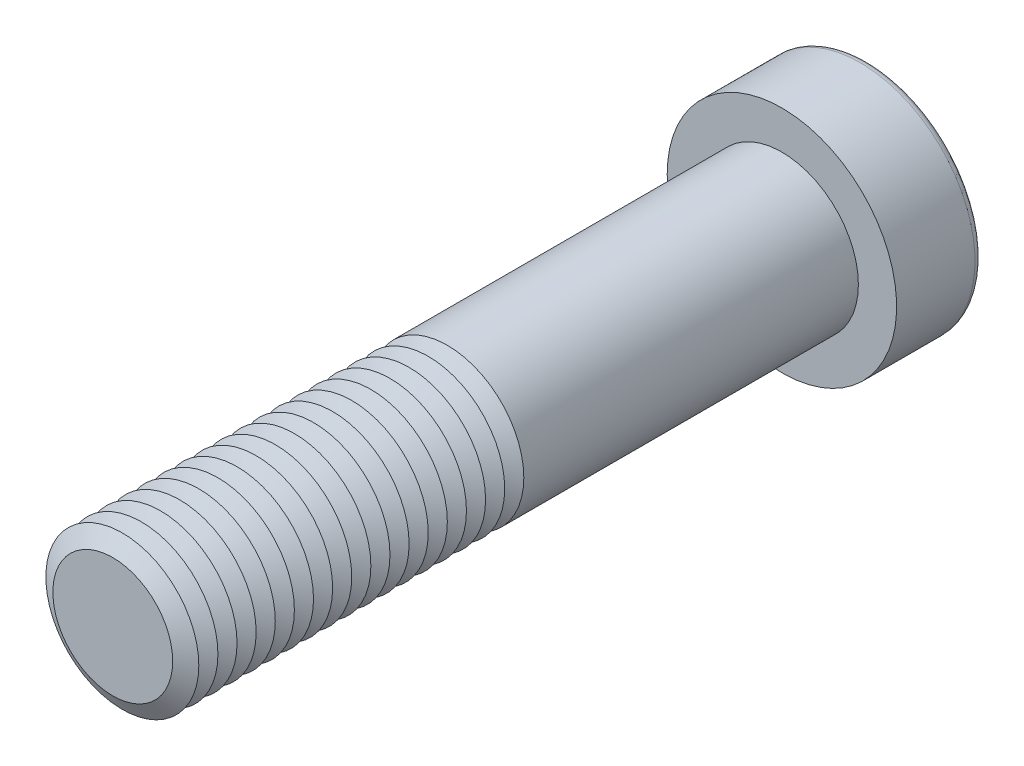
ISO-10303-21;
HEADER;
FILE_DESCRIPTION(('STEP AP214'),'2;1');
FILE_NAME('part.step','',(''),(''),'','','');
FILE_SCHEMA(('AUTOMOTIVE_DESIGN { 1 0 10303 214 1 1 1 1 }'));
ENDSEC;
DATA;
#1=APPLICATION_CONTEXT('core data for automotive mechanical design processes');
#2=APPLICATION_PROTOCOL_DEFINITION('international standard','automotive_design',2000,#1);
#3=PRODUCT_CONTEXT('',#1,'mechanical');
#4=PRODUCT('Part','Part','',(#3));
#5=PRODUCT_RELATED_PRODUCT_CATEGORY('part','',(#4));
#6=PRODUCT_DEFINITION_FORMATION('','',#4);
#7=PRODUCT_DEFINITION_CONTEXT('part definition',#1,'design');
#8=PRODUCT_DEFINITION('design','',#6,#7);
#9=PRODUCT_DEFINITION_SHAPE('','',#8);
#10=(LENGTH_UNIT() NAMED_UNIT(*) SI_UNIT(.MILLI.,.METRE.));
#11=(NAMED_UNIT(*) PLANE_ANGLE_UNIT() SI_UNIT($,.RADIAN.));
#12=(NAMED_UNIT(*) SI_UNIT($,.STERADIAN.) SOLID_ANGLE_UNIT());
#13=UNCERTAINTY_MEASURE_WITH_UNIT(LENGTH_MEASURE(1.E-05),#10,'distance_accuracy_value','');
#14=(GEOMETRIC_REPRESENTATION_CONTEXT(3) GLOBAL_UNCERTAINTY_ASSIGNED_CONTEXT((#13)) GLOBAL_UNIT_ASSIGNED_CONTEXT((#10,
#11,#12)) REPRESENTATION_CONTEXT('',''));
#15=CARTESIAN_POINT('',(0.,0.,0.));
#16=DIRECTION('',(0.,0.,1.));
#17=DIRECTION('',(1.,0.,0.));
#18=AXIS2_PLACEMENT_3D('',#15,#16,#17);
#19=CARTESIAN_POINT('',(0.,0.,63.));
#20=DIRECTION('',(0.,0.,1.));
#21=DIRECTION('',(1.,0.,0.));
#22=AXIS2_PLACEMENT_3D('',#19,#20,#21);
#23=CONICAL_SURFACE('',#22,8.,1.0471975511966);
#24=CARTESIAN_POINT('',(0.,0.,62.));
#25=DIRECTION('',(0.,0.,1.));
#26=DIRECTION('',(1.,0.,0.));
#27=AXIS2_PLACEMENT_3D('',#24,#25,#26);
#28=CIRCLE('',#27,6.26794919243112);
#29=CARTESIAN_POINT('',(6.26794919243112,0.,62.));
#30=VERTEX_POINT('',#29);
#31=EDGE_CURVE('E313',#30,#30,#28,.T.);
#32=ORIENTED_EDGE('',*,*,#31,.T.);
#33=EDGE_LOOP('',(#32));
#34=FACE_BOUND('',#33,.T.);
#35=CARTESIAN_POINT('',(0.,0.,63.));
#36=DIRECTION('',(0.,0.,1.));
#37=DIRECTION('',(1.,0.,0.));
#38=AXIS2_PLACEMENT_3D('',#35,#36,#37);
#39=CIRCLE('',#38,8.);
#40=CARTESIAN_POINT('',(8.,0.,63.));
#41=VERTEX_POINT('',#40);
#42=EDGE_CURVE('E316',#41,#41,#39,.T.);
#43=ORIENTED_EDGE('',*,*,#42,.F.);
#44=EDGE_LOOP('',(#43));
#45=FACE_BOUND('',#44,.T.);
#46=ADVANCED_FACE('F39',(#34,#45),#23,.T.);
#47=CARTESIAN_POINT('',(0.,0.,62.));
#48=DIRECTION('',(0.,0.,-1.));
#49=DIRECTION('',(-1.,0.,0.));
#50=AXIS2_PLACEMENT_3D('',#47,#48,#49);
#51=CONICAL_SURFACE('',#50,6.26794919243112,1.0471975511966);
#52=CARTESIAN_POINT('',(0.,0.,61.));
#53=DIRECTION('',(0.,0.,1.));
#54=DIRECTION('',(1.,0.,0.));
#55=AXIS2_PLACEMENT_3D('',#52,#53,#54);
#56=CIRCLE('',#55,8.);
#57=CARTESIAN_POINT('',(8.,0.,61.));
#58=VERTEX_POINT('',#57);
#59=EDGE_CURVE('E324',#58,#58,#56,.T.);
#60=ORIENTED_EDGE('',*,*,#59,.T.);
#61=EDGE_LOOP('',(#60));
#62=FACE_BOUND('',#61,.T.);
#63=ORIENTED_EDGE('',*,*,#31,.F.);
#64=EDGE_LOOP('',(#63));
#65=FACE_BOUND('',#64,.T.);
#66=ADVANCED_FACE('F245',(#62,#65),#51,.T.);
#67=CARTESIAN_POINT('',(0.,0.,70.));
#68=DIRECTION('',(0.,0.,1.));
#69=DIRECTION('',(1.,0.,0.));
#70=AXIS2_PLACEMENT_3D('',#67,#68,#69);
#71=PLANE('',#70);
#72=CARTESIAN_POINT('',(0.,0.,70.));
#73=DIRECTION('',(0.,0.,1.));
#74=DIRECTION('',(1.,0.,0.));
#75=AXIS2_PLACEMENT_3D('',#72,#73,#74);
#76=CIRCLE('',#75,6.26794919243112);
#77=CARTESIAN_POINT('',(6.26794919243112,0.,70.));
#78=VERTEX_POINT('',#77);
#79=EDGE_CURVE('E174',#78,#78,#76,.T.);
#80=ORIENTED_EDGE('',*,*,#79,.T.);
#81=EDGE_LOOP('',(#80));
#82=FACE_BOUND('',#81,.T.);
#83=ADVANCED_FACE('F251',(#82),#71,.T.);
#84=CARTESIAN_POINT('',(0.,0.,70.));
#85=DIRECTION('',(0.,0.,-1.));
#86=DIRECTION('',(-1.,0.,0.));
#87=AXIS2_PLACEMENT_3D('',#84,#85,#86);
#88=CONICAL_SURFACE('',#87,6.26794919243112,1.0471975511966);
#89=CARTESIAN_POINT('',(0.,0.,69.));
#90=DIRECTION('',(0.,0.,1.));
#91=DIRECTION('',(1.,0.,0.));
#92=AXIS2_PLACEMENT_3D('',#89,#90,#91);
#93=CIRCLE('',#92,8.);
#94=CARTESIAN_POINT('',(8.,0.,69.));
#95=VERTEX_POINT('',#94);
#96=EDGE_CURVE('E291',#95,#95,#93,.T.);
#97=ORIENTED_EDGE('',*,*,#96,.T.);
#98=EDGE_LOOP('',(#97));
#99=FACE_BOUND('',#98,.T.);
#100=ORIENTED_EDGE('',*,*,#79,.F.);
#101=EDGE_LOOP('',(#100));
#102=FACE_BOUND('',#101,.T.);
#103=ADVANCED_FACE('F199',(#99,#102),#88,.T.);
#104=CARTESIAN_POINT('',(0.,0.,69.));
#105=DIRECTION('',(0.,0.,1.));
#106=DIRECTION('',(1.,0.,0.));
#107=AXIS2_PLACEMENT_3D('',#104,#105,#106);
#108=CONICAL_SURFACE('',#107,8.,1.0471975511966);
#109=CARTESIAN_POINT('',(0.,0.,68.));
#110=DIRECTION('',(0.,0.,1.));
#111=DIRECTION('',(1.,0.,0.));
#112=AXIS2_PLACEMENT_3D('',#109,#110,#111);
#113=CIRCLE('',#112,6.26794919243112);
#114=CARTESIAN_POINT('',(6.26794919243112,0.,68.));
#115=VERTEX_POINT('',#114);
#116=EDGE_CURVE('E288',#115,#115,#113,.T.);
#117=ORIENTED_EDGE('',*,*,#116,.T.);
#118=EDGE_LOOP('',(#117));
#119=FACE_BOUND('',#118,.T.);
#120=ORIENTED_EDGE('',*,*,#96,.F.);
#121=EDGE_LOOP('',(#120));
#122=FACE_BOUND('',#121,.T.);
#123=ADVANCED_FACE('F277',(#119,#122),#108,.T.);
#124=CARTESIAN_POINT('',(0.,0.,68.));
#125=DIRECTION('',(0.,0.,-1.));
#126=DIRECTION('',(-1.,0.,0.));
#127=AXIS2_PLACEMENT_3D('',#124,#125,#126);
#128=CONICAL_SURFACE('',#127,6.26794919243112,1.0471975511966);
#129=CARTESIAN_POINT('',(0.,0.,67.));
#130=DIRECTION('',(0.,0.,1.));
#131=DIRECTION('',(1.,0.,0.));
#132=AXIS2_PLACEMENT_3D('',#129,#130,#131);
#133=CIRCLE('',#132,8.);
#134=CARTESIAN_POINT('',(8.,0.,67.));
#135=VERTEX_POINT('',#134);
#136=EDGE_CURVE('E299',#135,#135,#133,.T.);
#137=ORIENTED_EDGE('',*,*,#136,.T.);
#138=EDGE_LOOP('',(#137));
#139=FACE_BOUND('',#138,.T.);
#140=ORIENTED_EDGE('',*,*,#116,.F.);
#141=EDGE_LOOP('',(#140));
#142=FACE_BOUND('',#141,.T.);
#143=ADVANCED_FACE('F274',(#139,#142),#128,.T.);
#144=CARTESIAN_POINT('',(0.,0.,67.));
#145=DIRECTION('',(0.,0.,1.));
#146=DIRECTION('',(1.,0.,0.));
#147=AXIS2_PLACEMENT_3D('',#144,#145,#146);
#148=CONICAL_SURFACE('',#147,8.,1.0471975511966);
#149=CARTESIAN_POINT('',(0.,0.,66.));
#150=DIRECTION('',(0.,0.,1.));
#151=DIRECTION('',(1.,0.,0.));
#152=AXIS2_PLACEMENT_3D('',#149,#150,#151);
#153=CIRCLE('',#152,6.26794919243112);
#154=CARTESIAN_POINT('',(6.26794919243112,0.,66.));
#155=VERTEX_POINT('',#154);
#156=EDGE_CURVE('E293',#155,#155,#153,.T.);
#157=ORIENTED_EDGE('',*,*,#156,.T.);
#158=EDGE_LOOP('',(#157));
#159=FACE_BOUND('',#158,.T.);
#160=ORIENTED_EDGE('',*,*,#136,.F.);
#161=EDGE_LOOP('',(#160));
#162=FACE_BOUND('',#161,.T.);
#163=ADVANCED_FACE('F270',(#159,#162),#148,.T.);
#164=CARTESIAN_POINT('',(0.,0.,66.));
#165=DIRECTION('',(0.,0.,-1.));
#166=DIRECTION('',(-1.,0.,0.));
#167=AXIS2_PLACEMENT_3D('',#164,#165,#166);
#168=CONICAL_SURFACE('',#167,6.26794919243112,1.0471975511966);
#169=CARTESIAN_POINT('',(0.,0.,65.));
#170=DIRECTION('',(0.,0.,1.));
#171=DIRECTION('',(1.,0.,0.));
#172=AXIS2_PLACEMENT_3D('',#169,#170,#171);
#173=CIRCLE('',#172,8.);
#174=CARTESIAN_POINT('',(8.,0.,65.));
#175=VERTEX_POINT('',#174);
#176=EDGE_CURVE('E309',#175,#175,#173,.T.);
#177=ORIENTED_EDGE('',*,*,#176,.T.);
#178=EDGE_LOOP('',(#177));
#179=FACE_BOUND('',#178,.T.);
#180=ORIENTED_EDGE('',*,*,#156,.F.);
#181=EDGE_LOOP('',(#180));
#182=FACE_BOUND('',#181,.T.);
#183=ADVANCED_FACE('F266',(#179,#182),#168,.T.);
#184=CARTESIAN_POINT('',(0.,0.,65.));
#185=DIRECTION('',(0.,0.,1.));
#186=DIRECTION('',(1.,0.,0.));
#187=AXIS2_PLACEMENT_3D('',#184,#185,#186);
#188=CONICAL_SURFACE('',#187,8.,1.0471975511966);
#189=CARTESIAN_POINT('',(0.,0.,64.));
#190=DIRECTION('',(0.,0.,1.));
#191=DIRECTION('',(1.,0.,0.));
#192=AXIS2_PLACEMENT_3D('',#189,#190,#191);
#193=CIRCLE('',#192,6.26794919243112);
#194=CARTESIAN_POINT('',(6.26794919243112,0.,64.));
#195=VERTEX_POINT('',#194);
#196=EDGE_CURVE('E305',#195,#195,#193,.T.);
#197=ORIENTED_EDGE('',*,*,#196,.T.);
#198=EDGE_LOOP('',(#197));
#199=FACE_BOUND('',#198,.T.);
#200=ORIENTED_EDGE('',*,*,#176,.F.);
#201=EDGE_LOOP('',(#200));
#202=FACE_BOUND('',#201,.T.);
#203=ADVANCED_FACE('F262',(#199,#202),#188,.T.);
#204=CARTESIAN_POINT('',(0.,0.,64.));
#205=DIRECTION('',(0.,0.,-1.));
#206=DIRECTION('',(-1.,0.,0.));
#207=AXIS2_PLACEMENT_3D('',#204,#205,#206);
#208=CONICAL_SURFACE('',#207,6.26794919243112,1.0471975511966);
#209=ORIENTED_EDGE('',*,*,#42,.T.);
#210=EDGE_LOOP('',(#209));
#211=FACE_BOUND('',#210,.T.);
#212=ORIENTED_EDGE('',*,*,#196,.F.);
#213=EDGE_LOOP('',(#212));
#214=FACE_BOUND('',#213,.T.);
#215=ADVANCED_FACE('F258',(#211,#214),#208,.T.);
#216=CARTESIAN_POINT('',(0.,0.,61.));
#217=DIRECTION('',(0.,0.,1.));
#218=DIRECTION('',(1.,0.,0.));
#219=AXIS2_PLACEMENT_3D('',#216,#217,#218);
#220=CONICAL_SURFACE('',#219,8.,1.0471975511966);
#221=CARTESIAN_POINT('',(0.,0.,60.));
#222=DIRECTION('',(0.,0.,1.));
#223=DIRECTION('',(1.,0.,0.));
#224=AXIS2_PLACEMENT_3D('',#221,#222,#223);
#225=CIRCLE('',#224,6.26794919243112);
#226=CARTESIAN_POINT('',(6.26794919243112,0.,60.));
#227=VERTEX_POINT('',#226);
#228=EDGE_CURVE('E320',#227,#227,#225,.T.);
#229=ORIENTED_EDGE('',*,*,#228,.T.);
#230=EDGE_LOOP('',(#229));
#231=FACE_BOUND('',#230,.T.);
#232=ORIENTED_EDGE('',*,*,#59,.F.);
#233=EDGE_LOOP('',(#232));
#234=FACE_BOUND('',#233,.T.);
#235=ADVANCED_FACE('F261',(#231,#234),#220,.T.);
#236=CARTESIAN_POINT('',(0.,0.,60.));
#237=DIRECTION('',(0.,0.,-1.));
#238=DIRECTION('',(-1.,0.,0.));
#239=AXIS2_PLACEMENT_3D('',#236,#237,#238);
#240=CONICAL_SURFACE('',#239,6.26794919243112,1.0471975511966);
#241=CARTESIAN_POINT('',(0.,0.,59.));
#242=DIRECTION('',(0.,0.,1.));
#243=DIRECTION('',(1.,0.,0.));
#244=AXIS2_PLACEMENT_3D('',#241,#242,#243);
#245=CIRCLE('',#244,8.);
#246=CARTESIAN_POINT('',(8.,0.,59.));
#247=VERTEX_POINT('',#246);
#248=EDGE_CURVE('E332',#247,#247,#245,.T.);
#249=ORIENTED_EDGE('',*,*,#248,.T.);
#250=EDGE_LOOP('',(#249));
#251=FACE_BOUND('',#250,.T.);
#252=ORIENTED_EDGE('',*,*,#228,.F.);
#253=EDGE_LOOP('',(#252));
#254=FACE_BOUND('',#253,.T.);
#255=ADVANCED_FACE('F527',(#251,#254),#240,.T.);
#256=CARTESIAN_POINT('',(0.,0.,59.));
#257=DIRECTION('',(0.,0.,1.));
#258=DIRECTION('',(1.,0.,0.));
#259=AXIS2_PLACEMENT_3D('',#256,#257,#258);
#260=CONICAL_SURFACE('',#259,8.,1.0471975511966);
#261=CARTESIAN_POINT('',(0.,0.,58.));
#262=DIRECTION('',(0.,0.,1.));
#263=DIRECTION('',(1.,0.,0.));
#264=AXIS2_PLACEMENT_3D('',#261,#262,#263);
#265=CIRCLE('',#264,6.26794919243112);
#266=CARTESIAN_POINT('',(6.26794919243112,0.,58.));
#267=VERTEX_POINT('',#266);
#268=EDGE_CURVE('E328',#267,#267,#265,.T.);
#269=ORIENTED_EDGE('',*,*,#268,.T.);
#270=EDGE_LOOP('',(#269));
#271=FACE_BOUND('',#270,.T.);
#272=ORIENTED_EDGE('',*,*,#248,.F.);
#273=EDGE_LOOP('',(#272));
#274=FACE_BOUND('',#273,.T.);
#275=ADVANCED_FACE('F523',(#271,#274),#260,.T.);
#276=CARTESIAN_POINT('',(0.,0.,58.));
#277=DIRECTION('',(0.,0.,-1.));
#278=DIRECTION('',(-1.,0.,0.));
#279=AXIS2_PLACEMENT_3D('',#276,#277,#278);
#280=CONICAL_SURFACE('',#279,6.26794919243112,1.0471975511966);
#281=CARTESIAN_POINT('',(0.,0.,57.));
#282=DIRECTION('',(0.,0.,1.));
#283=DIRECTION('',(1.,0.,0.));
#284=AXIS2_PLACEMENT_3D('',#281,#282,#283);
#285=CIRCLE('',#284,8.);
#286=CARTESIAN_POINT('',(8.,0.,57.));
#287=VERTEX_POINT('',#286);
#288=EDGE_CURVE('E340',#287,#287,#285,.T.);
#289=ORIENTED_EDGE('',*,*,#288,.T.);
#290=EDGE_LOOP('',(#289));
#291=FACE_BOUND('',#290,.T.);
#292=ORIENTED_EDGE('',*,*,#268,.F.);
#293=EDGE_LOOP('',(#292));
#294=FACE_BOUND('',#293,.T.);
#295=ADVANCED_FACE('F519',(#291,#294),#280,.T.);
#296=CARTESIAN_POINT('',(0.,0.,57.));
#297=DIRECTION('',(0.,0.,1.));
#298=DIRECTION('',(1.,0.,0.));
#299=AXIS2_PLACEMENT_3D('',#296,#297,#298);
#300=CONICAL_SURFACE('',#299,8.,1.0471975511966);
#301=CARTESIAN_POINT('',(0.,0.,56.));
#302=DIRECTION('',(0.,0.,1.));
#303=DIRECTION('',(1.,0.,0.));
#304=AXIS2_PLACEMENT_3D('',#301,#302,#303);
#305=CIRCLE('',#304,6.26794919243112);
#306=CARTESIAN_POINT('',(6.26794919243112,0.,56.));
#307=VERTEX_POINT('',#306);
#308=EDGE_CURVE('E336',#307,#307,#305,.T.);
#309=ORIENTED_EDGE('',*,*,#308,.T.);
#310=EDGE_LOOP('',(#309));
#311=FACE_BOUND('',#310,.T.);
#312=ORIENTED_EDGE('',*,*,#288,.F.);
#313=EDGE_LOOP('',(#312));
#314=FACE_BOUND('',#313,.T.);
#315=ADVANCED_FACE('F515',(#311,#314),#300,.T.);
#316=CARTESIAN_POINT('',(0.,0.,56.));
#317=DIRECTION('',(0.,0.,-1.));
#318=DIRECTION('',(-1.,0.,0.));
#319=AXIS2_PLACEMENT_3D('',#316,#317,#318);
#320=CONICAL_SURFACE('',#319,6.26794919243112,1.0471975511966);
#321=CARTESIAN_POINT('',(0.,0.,55.));
#322=DIRECTION('',(0.,0.,1.));
#323=DIRECTION('',(1.,0.,0.));
#324=AXIS2_PLACEMENT_3D('',#321,#322,#323);
#325=CIRCLE('',#324,8.);
#326=CARTESIAN_POINT('',(8.,0.,55.));
#327=VERTEX_POINT('',#326);
#328=EDGE_CURVE('E347',#327,#327,#325,.T.);
#329=ORIENTED_EDGE('',*,*,#328,.T.);
#330=EDGE_LOOP('',(#329));
#331=FACE_BOUND('',#330,.T.);
#332=ORIENTED_EDGE('',*,*,#308,.F.);
#333=EDGE_LOOP('',(#332));
#334=FACE_BOUND('',#333,.T.);
#335=ADVANCED_FACE('F511',(#331,#334),#320,.T.);
#336=CARTESIAN_POINT('',(0.,0.,55.));
#337=DIRECTION('',(0.,0.,1.));
#338=DIRECTION('',(1.,0.,0.));
#339=AXIS2_PLACEMENT_3D('',#336,#337,#338);
#340=CONICAL_SURFACE('',#339,8.,1.0471975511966);
#341=CARTESIAN_POINT('',(0.,0.,54.));
#342=DIRECTION('',(0.,0.,1.));
#343=DIRECTION('',(1.,0.,0.));
#344=AXIS2_PLACEMENT_3D('',#341,#342,#343);
#345=CIRCLE('',#344,6.26794919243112);
#346=CARTESIAN_POINT('',(6.26794919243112,0.,54.));
#347=VERTEX_POINT('',#346);
#348=EDGE_CURVE('E343',#347,#347,#345,.T.);
#349=ORIENTED_EDGE('',*,*,#348,.T.);
#350=EDGE_LOOP('',(#349));
#351=FACE_BOUND('',#350,.T.);
#352=ORIENTED_EDGE('',*,*,#328,.F.);
#353=EDGE_LOOP('',(#352));
#354=FACE_BOUND('',#353,.T.);
#355=ADVANCED_FACE('F507',(#351,#354),#340,.T.);
#356=CARTESIAN_POINT('',(0.,0.,54.));
#357=DIRECTION('',(0.,0.,-1.));
#358=DIRECTION('',(-1.,0.,0.));
#359=AXIS2_PLACEMENT_3D('',#356,#357,#358);
#360=CONICAL_SURFACE('',#359,6.26794919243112,1.0471975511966);
#361=CARTESIAN_POINT('',(0.,0.,53.));
#362=DIRECTION('',(0.,0.,1.));
#363=DIRECTION('',(1.,0.,0.));
#364=AXIS2_PLACEMENT_3D('',#361,#362,#363);
#365=CIRCLE('',#364,8.);
#366=CARTESIAN_POINT('',(8.,0.,53.));
#367=VERTEX_POINT('',#366);
#368=EDGE_CURVE('E355',#367,#367,#365,.T.);
#369=ORIENTED_EDGE('',*,*,#368,.T.);
#370=EDGE_LOOP('',(#369));
#371=FACE_BOUND('',#370,.T.);
#372=ORIENTED_EDGE('',*,*,#348,.F.);
#373=EDGE_LOOP('',(#372));
#374=FACE_BOUND('',#373,.T.);
#375=ADVANCED_FACE('F503',(#371,#374),#360,.T.);
#376=CARTESIAN_POINT('',(0.,0.,53.));
#377=DIRECTION('',(0.,0.,1.));
#378=DIRECTION('',(1.,0.,0.));
#379=AXIS2_PLACEMENT_3D('',#376,#377,#378);
#380=CONICAL_SURFACE('',#379,8.,1.0471975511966);
#381=CARTESIAN_POINT('',(0.,0.,52.));
#382=DIRECTION('',(0.,0.,1.));
#383=DIRECTION('',(1.,0.,0.));
#384=AXIS2_PLACEMENT_3D('',#381,#382,#383);
#385=CIRCLE('',#384,6.26794919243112);
#386=CARTESIAN_POINT('',(6.26794919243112,0.,52.));
#387=VERTEX_POINT('',#386);
#388=EDGE_CURVE('E351',#387,#387,#385,.T.);
#389=ORIENTED_EDGE('',*,*,#388,.T.);
#390=EDGE_LOOP('',(#389));
#391=FACE_BOUND('',#390,.T.);
#392=ORIENTED_EDGE('',*,*,#368,.F.);
#393=EDGE_LOOP('',(#392));
#394=FACE_BOUND('',#393,.T.);
#395=ADVANCED_FACE('F499',(#391,#394),#380,.T.);
#396=CARTESIAN_POINT('',(0.,0.,52.));
#397=DIRECTION('',(0.,0.,-1.));
#398=DIRECTION('',(-1.,0.,0.));
#399=AXIS2_PLACEMENT_3D('',#396,#397,#398);
#400=CONICAL_SURFACE('',#399,6.26794919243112,1.0471975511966);
#401=CARTESIAN_POINT('',(0.,0.,51.));
#402=DIRECTION('',(0.,0.,1.));
#403=DIRECTION('',(1.,0.,0.));
#404=AXIS2_PLACEMENT_3D('',#401,#402,#403);
#405=CIRCLE('',#404,8.);
#406=CARTESIAN_POINT('',(8.,0.,51.));
#407=VERTEX_POINT('',#406);
#408=EDGE_CURVE('E363',#407,#407,#405,.T.);
#409=ORIENTED_EDGE('',*,*,#408,.T.);
#410=EDGE_LOOP('',(#409));
#411=FACE_BOUND('',#410,.T.);
#412=ORIENTED_EDGE('',*,*,#388,.F.);
#413=EDGE_LOOP('',(#412));
#414=FACE_BOUND('',#413,.T.);
#415=ADVANCED_FACE('F495',(#411,#414),#400,.T.);
#416=CARTESIAN_POINT('',(0.,0.,51.));
#417=DIRECTION('',(0.,0.,1.));
#418=DIRECTION('',(1.,0.,0.));
#419=AXIS2_PLACEMENT_3D('',#416,#417,#418);
#420=CONICAL_SURFACE('',#419,8.,1.0471975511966);
#421=CARTESIAN_POINT('',(0.,0.,50.));
#422=DIRECTION('',(0.,0.,1.));
#423=DIRECTION('',(1.,0.,0.));
#424=AXIS2_PLACEMENT_3D('',#421,#422,#423);
#425=CIRCLE('',#424,6.26794919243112);
#426=CARTESIAN_POINT('',(6.26794919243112,0.,50.));
#427=VERTEX_POINT('',#426);
#428=EDGE_CURVE('E359',#427,#427,#425,.T.);
#429=ORIENTED_EDGE('',*,*,#428,.T.);
#430=EDGE_LOOP('',(#429));
#431=FACE_BOUND('',#430,.T.);
#432=ORIENTED_EDGE('',*,*,#408,.F.);
#433=EDGE_LOOP('',(#432));
#434=FACE_BOUND('',#433,.T.);
#435=ADVANCED_FACE('F491',(#431,#434),#420,.T.);
#436=CARTESIAN_POINT('',(0.,0.,50.));
#437=DIRECTION('',(0.,0.,-1.));
#438=DIRECTION('',(-1.,0.,0.));
#439=AXIS2_PLACEMENT_3D('',#436,#437,#438);
#440=CONICAL_SURFACE('',#439,6.26794919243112,1.0471975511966);
#441=CARTESIAN_POINT('',(0.,0.,49.));
#442=DIRECTION('',(0.,0.,1.));
#443=DIRECTION('',(1.,0.,0.));
#444=AXIS2_PLACEMENT_3D('',#441,#442,#443);
#445=CIRCLE('',#444,8.);
#446=CARTESIAN_POINT('',(8.,0.,49.));
#447=VERTEX_POINT('',#446);
#448=EDGE_CURVE('E370',#447,#447,#445,.T.);
#449=ORIENTED_EDGE('',*,*,#448,.T.);
#450=EDGE_LOOP('',(#449));
#451=FACE_BOUND('',#450,.T.);
#452=ORIENTED_EDGE('',*,*,#428,.F.);
#453=EDGE_LOOP('',(#452));
#454=FACE_BOUND('',#453,.T.);
#455=ADVANCED_FACE('F487',(#451,#454),#440,.T.);
#456=CARTESIAN_POINT('',(0.,0.,49.));
#457=DIRECTION('',(0.,0.,1.));
#458=DIRECTION('',(1.,0.,0.));
#459=AXIS2_PLACEMENT_3D('',#456,#457,#458);
#460=CONICAL_SURFACE('',#459,8.,1.0471975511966);
#461=CARTESIAN_POINT('',(0.,0.,48.));
#462=DIRECTION('',(0.,0.,1.));
#463=DIRECTION('',(1.,0.,0.));
#464=AXIS2_PLACEMENT_3D('',#461,#462,#463);
#465=CIRCLE('',#464,6.26794919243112);
#466=CARTESIAN_POINT('',(6.26794919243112,0.,48.));
#467=VERTEX_POINT('',#466);
#468=EDGE_CURVE('E366',#467,#467,#465,.T.);
#469=ORIENTED_EDGE('',*,*,#468,.T.);
#470=EDGE_LOOP('',(#469));
#471=FACE_BOUND('',#470,.T.);
#472=ORIENTED_EDGE('',*,*,#448,.F.);
#473=EDGE_LOOP('',(#472));
#474=FACE_BOUND('',#473,.T.);
#475=ADVANCED_FACE('F483',(#471,#474),#460,.T.);
#476=CARTESIAN_POINT('',(0.,0.,48.));
#477=DIRECTION('',(0.,0.,-1.));
#478=DIRECTION('',(-1.,0.,0.));
#479=AXIS2_PLACEMENT_3D('',#476,#477,#478);
#480=CONICAL_SURFACE('',#479,6.26794919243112,1.0471975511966);
#481=CARTESIAN_POINT('',(0.,0.,47.));
#482=DIRECTION('',(0.,0.,1.));
#483=DIRECTION('',(1.,0.,0.));
#484=AXIS2_PLACEMENT_3D('',#481,#482,#483);
#485=CIRCLE('',#484,8.);
#486=CARTESIAN_POINT('',(8.,0.,47.));
#487=VERTEX_POINT('',#486);
#488=EDGE_CURVE('E378',#487,#487,#485,.T.);
#489=ORIENTED_EDGE('',*,*,#488,.T.);
#490=EDGE_LOOP('',(#489));
#491=FACE_BOUND('',#490,.T.);
#492=ORIENTED_EDGE('',*,*,#468,.F.);
#493=EDGE_LOOP('',(#492));
#494=FACE_BOUND('',#493,.T.);
#495=ADVANCED_FACE('F479',(#491,#494),#480,.T.);
#496=CARTESIAN_POINT('',(0.,0.,47.));
#497=DIRECTION('',(0.,0.,1.));
#498=DIRECTION('',(1.,0.,0.));
#499=AXIS2_PLACEMENT_3D('',#496,#497,#498);
#500=CONICAL_SURFACE('',#499,8.,1.0471975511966);
#501=CARTESIAN_POINT('',(0.,0.,46.));
#502=DIRECTION('',(0.,0.,1.));
#503=DIRECTION('',(1.,0.,0.));
#504=AXIS2_PLACEMENT_3D('',#501,#502,#503);
#505=CIRCLE('',#504,6.26794919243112);
#506=CARTESIAN_POINT('',(6.26794919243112,0.,46.));
#507=VERTEX_POINT('',#506);
#508=EDGE_CURVE('E374',#507,#507,#505,.T.);
#509=ORIENTED_EDGE('',*,*,#508,.T.);
#510=EDGE_LOOP('',(#509));
#511=FACE_BOUND('',#510,.T.);
#512=ORIENTED_EDGE('',*,*,#488,.F.);
#513=EDGE_LOOP('',(#512));
#514=FACE_BOUND('',#513,.T.);
#515=ADVANCED_FACE('F475',(#511,#514),#500,.T.);
#516=CARTESIAN_POINT('',(0.,0.,46.));
#517=DIRECTION('',(0.,0.,-1.));
#518=DIRECTION('',(-1.,0.,0.));
#519=AXIS2_PLACEMENT_3D('',#516,#517,#518);
#520=CONICAL_SURFACE('',#519,6.26794919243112,1.0471975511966);
#521=CARTESIAN_POINT('',(0.,0.,45.));
#522=DIRECTION('',(0.,0.,1.));
#523=DIRECTION('',(1.,0.,0.));
#524=AXIS2_PLACEMENT_3D('',#521,#522,#523);
#525=CIRCLE('',#524,8.);
#526=CARTESIAN_POINT('',(8.,0.,45.));
#527=VERTEX_POINT('',#526);
#528=EDGE_CURVE('E386',#527,#527,#525,.T.);
#529=ORIENTED_EDGE('',*,*,#528,.T.);
#530=EDGE_LOOP('',(#529));
#531=FACE_BOUND('',#530,.T.);
#532=ORIENTED_EDGE('',*,*,#508,.F.);
#533=EDGE_LOOP('',(#532));
#534=FACE_BOUND('',#533,.T.);
#535=ADVANCED_FACE('F471',(#531,#534),#520,.T.);
#536=CARTESIAN_POINT('',(0.,0.,45.));
#537=DIRECTION('',(0.,0.,1.));
#538=DIRECTION('',(1.,0.,0.));
#539=AXIS2_PLACEMENT_3D('',#536,#537,#538);
#540=CONICAL_SURFACE('',#539,8.,1.0471975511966);
#541=CARTESIAN_POINT('',(0.,0.,44.));
#542=DIRECTION('',(0.,0.,1.));
#543=DIRECTION('',(1.,0.,0.));
#544=AXIS2_PLACEMENT_3D('',#541,#542,#543);
#545=CIRCLE('',#544,6.26794919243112);
#546=CARTESIAN_POINT('',(6.26794919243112,0.,44.));
#547=VERTEX_POINT('',#546);
#548=EDGE_CURVE('E382',#547,#547,#545,.T.);
#549=ORIENTED_EDGE('',*,*,#548,.T.);
#550=EDGE_LOOP('',(#549));
#551=FACE_BOUND('',#550,.T.);
#552=ORIENTED_EDGE('',*,*,#528,.F.);
#553=EDGE_LOOP('',(#552));
#554=FACE_BOUND('',#553,.T.);
#555=ADVANCED_FACE('F467',(#551,#554),#540,.T.);
#556=CARTESIAN_POINT('',(0.,0.,44.));
#557=DIRECTION('',(0.,0.,-1.));
#558=DIRECTION('',(-1.,0.,0.));
#559=AXIS2_PLACEMENT_3D('',#556,#557,#558);
#560=CONICAL_SURFACE('',#559,6.26794919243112,1.0471975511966);
#561=CARTESIAN_POINT('',(0.,0.,43.));
#562=DIRECTION('',(0.,0.,1.));
#563=DIRECTION('',(1.,0.,0.));
#564=AXIS2_PLACEMENT_3D('',#561,#562,#563);
#565=CIRCLE('',#564,8.);
#566=CARTESIAN_POINT('',(8.,0.,43.));
#567=VERTEX_POINT('',#566);
#568=EDGE_CURVE('E394',#567,#567,#565,.T.);
#569=ORIENTED_EDGE('',*,*,#568,.T.);
#570=EDGE_LOOP('',(#569));
#571=FACE_BOUND('',#570,.T.);
#572=ORIENTED_EDGE('',*,*,#548,.F.);
#573=EDGE_LOOP('',(#572));
#574=FACE_BOUND('',#573,.T.);
#575=ADVANCED_FACE('F463',(#571,#574),#560,.T.);
#576=CARTESIAN_POINT('',(0.,0.,43.));
#577=DIRECTION('',(0.,0.,1.));
#578=DIRECTION('',(1.,0.,0.));
#579=AXIS2_PLACEMENT_3D('',#576,#577,#578);
#580=CONICAL_SURFACE('',#579,8.,1.0471975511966);
#581=CARTESIAN_POINT('',(0.,0.,42.));
#582=DIRECTION('',(0.,0.,1.));
#583=DIRECTION('',(1.,0.,0.));
#584=AXIS2_PLACEMENT_3D('',#581,#582,#583);
#585=CIRCLE('',#584,6.26794919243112);
#586=CARTESIAN_POINT('',(6.26794919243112,0.,42.));
#587=VERTEX_POINT('',#586);
#588=EDGE_CURVE('E390',#587,#587,#585,.T.);
#589=ORIENTED_EDGE('',*,*,#588,.T.);
#590=EDGE_LOOP('',(#589));
#591=FACE_BOUND('',#590,.T.);
#592=ORIENTED_EDGE('',*,*,#568,.F.);
#593=EDGE_LOOP('',(#592));
#594=FACE_BOUND('',#593,.T.);
#595=ADVANCED_FACE('F459',(#591,#594),#580,.T.);
#596=CARTESIAN_POINT('',(0.,0.,42.));
#597=DIRECTION('',(0.,0.,-1.));
#598=DIRECTION('',(-1.,0.,0.));
#599=AXIS2_PLACEMENT_3D('',#596,#597,#598);
#600=CONICAL_SURFACE('',#599,6.26794919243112,1.0471975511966);
#601=CARTESIAN_POINT('',(0.,0.,41.));
#602=DIRECTION('',(0.,0.,1.));
#603=DIRECTION('',(1.,0.,0.));
#604=AXIS2_PLACEMENT_3D('',#601,#602,#603);
#605=CIRCLE('',#604,8.);
#606=CARTESIAN_POINT('',(8.,0.,41.));
#607=VERTEX_POINT('',#606);
#608=EDGE_CURVE('E402',#607,#607,#605,.T.);
#609=ORIENTED_EDGE('',*,*,#608,.T.);
#610=EDGE_LOOP('',(#609));
#611=FACE_BOUND('',#610,.T.);
#612=ORIENTED_EDGE('',*,*,#588,.F.);
#613=EDGE_LOOP('',(#612));
#614=FACE_BOUND('',#613,.T.);
#615=ADVANCED_FACE('F455',(#611,#614),#600,.T.);
#616=CARTESIAN_POINT('',(0.,0.,41.));
#617=DIRECTION('',(0.,0.,1.));
#618=DIRECTION('',(1.,0.,0.));
#619=AXIS2_PLACEMENT_3D('',#616,#617,#618);
#620=CONICAL_SURFACE('',#619,8.,1.0471975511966);
#621=CARTESIAN_POINT('',(0.,0.,40.));
#622=DIRECTION('',(0.,0.,1.));
#623=DIRECTION('',(1.,0.,0.));
#624=AXIS2_PLACEMENT_3D('',#621,#622,#623);
#625=CIRCLE('',#624,6.26794919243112);
#626=CARTESIAN_POINT('',(6.26794919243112,0.,40.));
#627=VERTEX_POINT('',#626);
#628=EDGE_CURVE('E398',#627,#627,#625,.T.);
#629=ORIENTED_EDGE('',*,*,#628,.T.);
#630=EDGE_LOOP('',(#629));
#631=FACE_BOUND('',#630,.T.);
#632=ORIENTED_EDGE('',*,*,#608,.F.);
#633=EDGE_LOOP('',(#632));
#634=FACE_BOUND('',#633,.T.);
#635=ADVANCED_FACE('F451',(#631,#634),#620,.T.);
#636=CARTESIAN_POINT('',(0.,0.,40.));
#637=DIRECTION('',(0.,0.,-1.));
#638=DIRECTION('',(-1.,0.,0.));
#639=AXIS2_PLACEMENT_3D('',#636,#637,#638);
#640=CONICAL_SURFACE('',#639,6.26794919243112,1.0471975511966);
#641=CARTESIAN_POINT('',(0.,0.,39.));
#642=DIRECTION('',(0.,0.,1.));
#643=DIRECTION('',(1.,0.,0.));
#644=AXIS2_PLACEMENT_3D('',#641,#642,#643);
#645=CIRCLE('',#644,8.);
#646=CARTESIAN_POINT('',(8.,0.,39.));
#647=VERTEX_POINT('',#646);
#648=EDGE_CURVE('E410',#647,#647,#645,.T.);
#649=ORIENTED_EDGE('',*,*,#648,.T.);
#650=EDGE_LOOP('',(#649));
#651=FACE_BOUND('',#650,.T.);
#652=ORIENTED_EDGE('',*,*,#628,.F.);
#653=EDGE_LOOP('',(#652));
#654=FACE_BOUND('',#653,.T.);
#655=ADVANCED_FACE('F447',(#651,#654),#640,.T.);
#656=CARTESIAN_POINT('',(0.,0.,39.));
#657=DIRECTION('',(0.,0.,1.));
#658=DIRECTION('',(1.,0.,0.));
#659=AXIS2_PLACEMENT_3D('',#656,#657,#658);
#660=CONICAL_SURFACE('',#659,8.,1.0471975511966);
#661=CARTESIAN_POINT('',(0.,0.,38.));
#662=DIRECTION('',(0.,0.,1.));
#663=DIRECTION('',(1.,0.,0.));
#664=AXIS2_PLACEMENT_3D('',#661,#662,#663);
#665=CIRCLE('',#664,6.26794919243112);
#666=CARTESIAN_POINT('',(6.26794919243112,0.,38.));
#667=VERTEX_POINT('',#666);
#668=EDGE_CURVE('E406',#667,#667,#665,.T.);
#669=ORIENTED_EDGE('',*,*,#668,.T.);
#670=EDGE_LOOP('',(#669));
#671=FACE_BOUND('',#670,.T.);
#672=ORIENTED_EDGE('',*,*,#648,.F.);
#673=EDGE_LOOP('',(#672));
#674=FACE_BOUND('',#673,.T.);
#675=ADVANCED_FACE('F442',(#671,#674),#660,.T.);
#676=CARTESIAN_POINT('',(0.,0.,38.));
#677=DIRECTION('',(0.,0.,-1.));
#678=DIRECTION('',(-1.,0.,0.));
#679=AXIS2_PLACEMENT_3D('',#676,#677,#678);
#680=CONICAL_SURFACE('',#679,6.26794919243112,1.0471975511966);
#681=CARTESIAN_POINT('',(0.,0.,37.));
#682=DIRECTION('',(0.,0.,1.));
#683=DIRECTION('',(1.,0.,0.));
#684=AXIS2_PLACEMENT_3D('',#681,#682,#683);
#685=CIRCLE('',#684,8.);
#686=CARTESIAN_POINT('',(8.,0.,37.));
#687=VERTEX_POINT('',#686);
#688=EDGE_CURVE('E422',#687,#687,#685,.T.);
#689=ORIENTED_EDGE('',*,*,#688,.T.);
#690=EDGE_LOOP('',(#689));
#691=FACE_BOUND('',#690,.T.);
#692=ORIENTED_EDGE('',*,*,#668,.F.);
#693=EDGE_LOOP('',(#692));
#694=FACE_BOUND('',#693,.T.);
#695=ADVANCED_FACE('F428',(#691,#694),#680,.T.);
#696=CARTESIAN_POINT('',(0.,0.,37.));
#697=DIRECTION('',(0.,0.,1.));
#698=DIRECTION('',(1.,0.,0.));
#699=AXIS2_PLACEMENT_3D('',#696,#697,#698);
#700=CONICAL_SURFACE('',#699,8.,1.0471975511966);
#701=CARTESIAN_POINT('',(0.,0.,36.));
#702=DIRECTION('',(0.,0.,1.));
#703=DIRECTION('',(1.,0.,0.));
#704=AXIS2_PLACEMENT_3D('',#701,#702,#703);
#705=CIRCLE('',#704,6.26794919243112);
#706=CARTESIAN_POINT('',(6.26794919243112,0.,36.));
#707=VERTEX_POINT('',#706);
#708=EDGE_CURVE('E414',#707,#707,#705,.T.);
#709=ORIENTED_EDGE('',*,*,#708,.T.);
#710=EDGE_LOOP('',(#709));
#711=FACE_BOUND('',#710,.T.);
#712=ORIENTED_EDGE('',*,*,#688,.F.);
#713=EDGE_LOOP('',(#712));
#714=FACE_BOUND('',#713,.T.);
#715=ADVANCED_FACE('F431',(#711,#714),#700,.T.);
#716=CARTESIAN_POINT('',(0.,0.,36.));
#717=DIRECTION('',(0.,0.,-1.));
#718=DIRECTION('',(-1.,0.,0.));
#719=AXIS2_PLACEMENT_3D('',#716,#717,#718);
#720=CONICAL_SURFACE('',#719,6.26794919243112,1.0471975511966);
#721=CARTESIAN_POINT('',(0.,0.,35.));
#722=DIRECTION('',(0.,0.,1.));
#723=DIRECTION('',(1.,0.,0.));
#724=AXIS2_PLACEMENT_3D('',#721,#722,#723);
#725=CIRCLE('',#724,8.);
#726=CARTESIAN_POINT('',(8.,0.,35.));
#727=VERTEX_POINT('',#726);
#728=EDGE_CURVE('E418',#727,#727,#725,.T.);
#729=ORIENTED_EDGE('',*,*,#728,.T.);
#730=EDGE_LOOP('',(#729));
#731=FACE_BOUND('',#730,.T.);
#732=ORIENTED_EDGE('',*,*,#708,.F.);
#733=EDGE_LOOP('',(#732));
#734=FACE_BOUND('',#733,.T.);
#735=ADVANCED_FACE('F433',(#731,#734),#720,.T.);
#736=CARTESIAN_POINT('',(0.,0.,0.));
#737=DIRECTION('',(0.,0.,-1.));
#738=DIRECTION('',(-1.,0.,0.));
#739=AXIS2_PLACEMENT_3D('',#736,#737,#738);
#740=CONICAL_SURFACE('',#739,6.,1.0471975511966);
#741=CARTESIAN_POINT('',(0.,0.,3.46410161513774));
#742=VERTEX_POINT('',#741);
#743=VERTEX_LOOP('',#742);
#744=FACE_BOUND('',#743,.T.);
#745=CARTESIAN_POINT('',(0.,0.,0.));
#746=DIRECTION('',(0.,0.,-1.));
#747=DIRECTION('',(-1.,0.,0.));
#748=AXIS2_PLACEMENT_3D('',#745,#746,#747);
#749=CIRCLE('',#748,6.);
#750=CARTESIAN_POINT('',(-5.19615242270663,3.,0.));
#751=VERTEX_POINT('',#750);
#752=CARTESIAN_POINT('',(0.,6.,0.));
#753=VERTEX_POINT('',#752);
#754=EDGE_CURVE('E149',#751,#753,#749,.T.);
#755=ORIENTED_EDGE('',*,*,#754,.T.);
#756=CARTESIAN_POINT('',(0.,0.,0.));
#757=DIRECTION('',(0.,0.,-1.));
#758=DIRECTION('',(-1.,0.,0.));
#759=AXIS2_PLACEMENT_3D('',#756,#757,#758);
#760=CIRCLE('',#759,6.);
#761=CARTESIAN_POINT('',(5.19615242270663,3.,0.));
#762=VERTEX_POINT('',#761);
#763=EDGE_CURVE('E54',#753,#762,#760,.T.);
#764=ORIENTED_EDGE('',*,*,#763,.T.);
#765=CARTESIAN_POINT('',(5.19615242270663,-3.,0.));
#766=VERTEX_POINT('',#765);
#767=EDGE_CURVE('E1055',#762,#766,#760,.T.);
#768=ORIENTED_EDGE('',*,*,#767,.T.);
#769=CARTESIAN_POINT('',(0.,-6.,0.));
#770=VERTEX_POINT('',#769);
#771=EDGE_CURVE('E1053',#766,#770,#760,.T.);
#772=ORIENTED_EDGE('',*,*,#771,.T.);
#773=CARTESIAN_POINT('',(-5.19615242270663,-3.,0.));
#774=VERTEX_POINT('',#773);
#775=EDGE_CURVE('E1047',#770,#774,#760,.T.);
#776=ORIENTED_EDGE('',*,*,#775,.T.);
#777=EDGE_CURVE('E1045',#774,#751,#760,.T.);
#778=ORIENTED_EDGE('',*,*,#777,.T.);
#779=EDGE_LOOP('',(#755,#764,#768,#772,#776,#778));
#780=FACE_BOUND('',#779,.T.);
#781=ADVANCED_FACE('F201',(#744,#780),#740,.F.);
#782=CARTESIAN_POINT('',(0.,0.,0.));
#783=DIRECTION('',(0.,0.,-1.));
#784=DIRECTION('',(-1.,0.,0.));
#785=AXIS2_PLACEMENT_3D('',#782,#783,#784);
#786=PLANE('',#785);
#787=ORIENTED_EDGE('',*,*,#763,.F.);
#788=DIRECTION('',(1.,0.,0.));
#789=VECTOR('',#788,1.);
#790=CARTESIAN_POINT('',(-3.46410161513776,6.,0.));
#791=LINE('',#790,#789);
#792=CARTESIAN_POINT('',(3.46410161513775,6.,0.));
#793=VERTEX_POINT('',#792);
#794=EDGE_CURVE('E1099',#753,#793,#791,.T.);
#795=ORIENTED_EDGE('',*,*,#794,.T.);
#796=DIRECTION('',(0.5,-0.866025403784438,0.));
#797=VECTOR('',#796,1.);
#798=CARTESIAN_POINT('',(3.46410161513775,6.,0.));
#799=LINE('',#798,#797);
#800=EDGE_CURVE('E155',#793,#762,#799,.T.);
#801=ORIENTED_EDGE('',*,*,#800,.T.);
#802=EDGE_LOOP('',(#787,#795,#801));
#803=FACE_BOUND('',#802,.T.);
#804=ADVANCED_FACE('F628',(#803),#786,.T.);
#805=ORIENTED_EDGE('',*,*,#767,.F.);
#806=CARTESIAN_POINT('',(6.92820323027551,0.,0.));
#807=VERTEX_POINT('',#806);
#808=EDGE_CURVE('E1094',#762,#807,#799,.T.);
#809=ORIENTED_EDGE('',*,*,#808,.T.);
#810=DIRECTION('',(-0.5,-0.866025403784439,0.));
#811=VECTOR('',#810,1.);
#812=CARTESIAN_POINT('',(6.92820323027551,0.,0.));
#813=LINE('',#812,#811);
#814=EDGE_CURVE('E1069',#807,#766,#813,.T.);
#815=ORIENTED_EDGE('',*,*,#814,.T.);
#816=EDGE_LOOP('',(#805,#809,#815));
#817=FACE_BOUND('',#816,.T.);
#818=ADVANCED_FACE('F638',(#817),#786,.T.);
#819=ORIENTED_EDGE('',*,*,#771,.F.);
#820=CARTESIAN_POINT('',(3.46410161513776,-6.,0.));
#821=VERTEX_POINT('',#820);
#822=EDGE_CURVE('E1071',#766,#821,#813,.T.);
#823=ORIENTED_EDGE('',*,*,#822,.T.);
#824=DIRECTION('',(-1.,0.,0.));
#825=VECTOR('',#824,1.);
#826=CARTESIAN_POINT('',(3.46410161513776,-6.,0.));
#827=LINE('',#826,#825);
#828=EDGE_CURVE('E1021',#821,#770,#827,.T.);
#829=ORIENTED_EDGE('',*,*,#828,.T.);
#830=EDGE_LOOP('',(#819,#823,#829));
#831=FACE_BOUND('',#830,.T.);
#832=ADVANCED_FACE('F648',(#831),#786,.T.);
#833=ORIENTED_EDGE('',*,*,#775,.F.);
#834=CARTESIAN_POINT('',(-3.46410161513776,-6.,0.));
#835=VERTEX_POINT('',#834);
#836=EDGE_CURVE('E1065',#770,#835,#827,.T.);
#837=ORIENTED_EDGE('',*,*,#836,.T.);
#838=DIRECTION('',(-0.5,0.866025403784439,0.));
#839=VECTOR('',#838,1.);
#840=CARTESIAN_POINT('',(-3.46410161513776,-6.,0.));
#841=LINE('',#840,#839);
#842=EDGE_CURVE('E1067',#835,#774,#841,.T.);
#843=ORIENTED_EDGE('',*,*,#842,.T.);
#844=EDGE_LOOP('',(#833,#837,#843));
#845=FACE_BOUND('',#844,.T.);
#846=ADVANCED_FACE('F656',(#845),#786,.T.);
#847=ORIENTED_EDGE('',*,*,#777,.F.);
#848=CARTESIAN_POINT('',(-6.92820323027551,0.,0.));
#849=VERTEX_POINT('',#848);
#850=EDGE_CURVE('E1073',#774,#849,#841,.T.);
#851=ORIENTED_EDGE('',*,*,#850,.T.);
#852=DIRECTION('',(0.5,0.866025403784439,0.));
#853=VECTOR('',#852,1.);
#854=CARTESIAN_POINT('',(-6.92820323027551,0.,0.));
#855=LINE('',#854,#853);
#856=EDGE_CURVE('E158',#849,#751,#855,.T.);
#857=ORIENTED_EDGE('',*,*,#856,.T.);
#858=EDGE_LOOP('',(#847,#851,#857));
#859=FACE_BOUND('',#858,.T.);
#860=ADVANCED_FACE('F231',(#859),#786,.T.);
#861=ORIENTED_EDGE('',*,*,#754,.F.);
#862=CARTESIAN_POINT('',(-3.46410161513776,6.,0.));
#863=VERTEX_POINT('',#862);
#864=EDGE_CURVE('E1079',#751,#863,#855,.T.);
#865=ORIENTED_EDGE('',*,*,#864,.T.);
#866=EDGE_CURVE('E1096',#863,#753,#791,.T.);
#867=ORIENTED_EDGE('',*,*,#866,.T.);
#868=EDGE_LOOP('',(#861,#865,#867));
#869=FACE_BOUND('',#868,.T.);
#870=ADVANCED_FACE('F640',(#869),#786,.T.);
#871=CARTESIAN_POINT('',(-3.46410161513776,6.,0.));
#872=DIRECTION('',(0.,1.,0.));
#873=DIRECTION('',(0.,0.,1.));
#874=AXIS2_PLACEMENT_3D('',#871,#872,#873);
#875=PLANE('',#874);
#876=DIRECTION('',(0.,0.,-1.));
#877=VECTOR('',#876,1.);
#878=CARTESIAN_POINT('',(-3.46410161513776,6.,0.));
#879=LINE('',#878,#877);
#880=CARTESIAN_POINT('',(-3.46410161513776,6.,-9.));
#881=VERTEX_POINT('',#880);
#882=EDGE_CURVE('E147',#863,#881,#879,.T.);
#883=ORIENTED_EDGE('',*,*,#882,.T.);
#884=CARTESIAN_POINT('',(-9.04322275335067,6.,-10.0515506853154));
#885=CARTESIAN_POINT('',(-8.77229389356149,6.,-9.99107568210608));
#886=CARTESIAN_POINT('',(-8.50119215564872,6.,-9.93136093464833));
#887=CARTESIAN_POINT('',(-7.95855825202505,6.,-9.81386229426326));
#888=CARTESIAN_POINT('',(-7.68702606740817,6.,-9.75607848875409));
#889=CARTESIAN_POINT('',(-7.14318995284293,6.,-9.64279905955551));
#890=CARTESIAN_POINT('',(-6.87088551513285,6.,-9.58730586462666));
#891=CARTESIAN_POINT('',(-6.32570082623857,6.,-9.47922577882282));
#892=CARTESIAN_POINT('',(-6.05282058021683,6.,-9.42663886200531));
#893=CARTESIAN_POINT('',(-5.50875458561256,6.,-9.32550177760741));
#894=CARTESIAN_POINT('',(-5.23757463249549,6.,-9.27692059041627));
#895=CARTESIAN_POINT('',(-4.69446863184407,6.,-9.18413302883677));
#896=CARTESIAN_POINT('',(-4.42254260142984,6.,-9.13992655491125));
#897=CARTESIAN_POINT('',(-3.87790333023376,6.,-9.05690830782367));
#898=CARTESIAN_POINT('',(-3.6051902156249,6.,-9.0180957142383));
#899=CARTESIAN_POINT('',(-3.05890080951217,6.,-8.94703062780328));
#900=CARTESIAN_POINT('',(-2.7853245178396,6.,-8.91477813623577));
#901=CARTESIAN_POINT('',(-2.23425545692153,6.,-8.85776959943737));
#902=CARTESIAN_POINT('',(-1.95675335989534,6.,-8.83310236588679));
#903=CARTESIAN_POINT('',(-1.40107824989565,6.,-8.79298360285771));
#904=CARTESIAN_POINT('',(-1.12290525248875,6.,-8.77753186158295));
#905=CARTESIAN_POINT('',(-0.566293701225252,6.,-8.75674610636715));
#906=CARTESIAN_POINT('',(-0.28785531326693,6.,-8.75140773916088));
#907=CARTESIAN_POINT('',(0.269026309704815,6.,-8.75117360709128));
#908=CARTESIAN_POINT('',(0.547469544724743,6.,-8.75627785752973));
#909=CARTESIAN_POINT('',(1.10511819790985,6.,-8.77664719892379));
#910=CARTESIAN_POINT('',(1.38432206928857,6.,-8.79195380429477));
#911=CARTESIAN_POINT('',(1.94205759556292,6.,-8.83187108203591));
#912=CARTESIAN_POINT('',(2.22058923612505,6.,-8.85648195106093));
#913=CARTESIAN_POINT('',(2.77698779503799,6.,-8.91379497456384));
#914=CARTESIAN_POINT('',(3.0548541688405,6.,-8.94650233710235));
#915=CARTESIAN_POINT('',(3.60969614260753,6.,-9.01868375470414));
#916=CARTESIAN_POINT('',(3.8866717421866,6.,-9.0581578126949));
#917=CARTESIAN_POINT('',(4.44700464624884,6.,-9.14374886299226));
#918=CARTESIAN_POINT('',(4.73033933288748,6.,-9.190012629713));
#919=CARTESIAN_POINT('',(5.29620685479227,6.,-9.28723184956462));
#920=CARTESIAN_POINT('',(5.57873966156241,6.,-9.3381874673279));
#921=CARTESIAN_POINT('',(6.14313105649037,6.,-9.44386031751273));
#922=CARTESIAN_POINT('',(6.42498956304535,6.,-9.49857798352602));
#923=CARTESIAN_POINT('',(6.98810511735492,6.,-9.61103289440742));
#924=CARTESIAN_POINT('',(7.26936215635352,6.,-9.66877018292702));
#925=CARTESIAN_POINT('',(8.11254995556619,6.,-9.84563705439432));
#926=CARTESIAN_POINT('',(8.67372006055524,6.,-9.96838761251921));
#927=CARTESIAN_POINT('',(9.79457370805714,6.,-10.2202420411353));
#928=CARTESIAN_POINT('',(10.3542573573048,6.,-10.3493454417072));
#929=CARTESIAN_POINT('',(11.4657945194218,6.,-10.6103395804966));
#930=CARTESIAN_POINT('',(12.0176605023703,6.,-10.7421773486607));
#931=CARTESIAN_POINT('',(13.1206665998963,6.,-11.0089002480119));
#932=CARTESIAN_POINT('',(13.6718066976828,6.,-11.1437854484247));
#933=CARTESIAN_POINT('',(14.7727697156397,6.,-11.4155878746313));
#934=CARTESIAN_POINT('',(15.3225934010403,6.,-11.5525020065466));
#935=CARTESIAN_POINT('',(16.4217957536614,6.,-11.8280226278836));
#936=CARTESIAN_POINT('',(16.971174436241,6.,-11.9666290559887));
#937=CARTESIAN_POINT('',(17.5204019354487,6.,-12.1058251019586));
#938=B_SPLINE_CURVE_WITH_KNOTS('',3,(#884,#885,#886,#887,#888,#889,#890,#891,#892,#893,#894,
#895,#896,#897,#898,#899,#900,#901,#902,#903,#904,#905,#906,#907,#908,#909,#910,#911,#912,#913,
#914,#915,#916,#917,#918,#919,#920,#921,#922,#923,#924,#925,#926,#927,#928,#929,#930,#931,#932,
#933,#934,#935,#936,#937),.UNSPECIFIED.,.F.,.F.,(4,2,2,2,2,2,2,2,2,2,2,2,2,2,2,2,2,2,2,2,2,2,2,
2,2,2,4),(0.,0.832792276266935,1.6656222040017,2.49931362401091,3.33299760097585,
4.15946050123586,4.98590459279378,5.81222284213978,6.63854125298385,7.47419540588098,
8.30983035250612,9.14510552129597,9.98038191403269,10.8190780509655,11.6577919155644,
12.4970466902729,13.336301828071,14.1975135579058,15.0587555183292,15.9200969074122,
16.7814507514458,18.5047000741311,20.2278221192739,21.929995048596,23.6322066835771,
25.3320460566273,27.0318240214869),.UNSPECIFIED.);
#939=CARTESIAN_POINT('',(3.46410161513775,6.,-9.));
#940=VERTEX_POINT('',#939);
#941=EDGE_CURVE('E124',#881,#940,#938,.T.);
#942=ORIENTED_EDGE('',*,*,#941,.T.);
#943=DIRECTION('',(0.,0.,-1.));
#944=VECTOR('',#943,1.);
#945=CARTESIAN_POINT('',(3.46410161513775,6.,0.));
#946=LINE('',#945,#944);
#947=EDGE_CURVE('E143',#793,#940,#946,.T.);
#948=ORIENTED_EDGE('',*,*,#947,.F.);
#949=ORIENTED_EDGE('',*,*,#794,.F.);
#950=ORIENTED_EDGE('',*,*,#866,.F.);
#951=EDGE_LOOP('',(#883,#942,#948,#949,#950));
#952=FACE_BOUND('',#951,.T.);
#953=ADVANCED_FACE('F141',(#952),#875,.F.);
#954=CARTESIAN_POINT('',(3.46410161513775,6.,0.));
#955=DIRECTION('',(0.866025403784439,0.5,0.));
#956=DIRECTION('',(-0.5,0.866025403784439,0.));
#957=AXIS2_PLACEMENT_3D('',#954,#955,#956);
#958=PLANE('',#957);
#959=ORIENTED_EDGE('',*,*,#947,.T.);
#960=CARTESIAN_POINT('',(3.46398614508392,6.0002,-9.00003094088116));
#961=CARTESIAN_POINT('',(3.60785114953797,5.75101850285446,-8.96146591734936));
#962=CARTESIAN_POINT('',(3.75197700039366,5.5013852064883,-8.92645521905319));
#963=CARTESIAN_POINT('',(4.0407377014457,5.00123700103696,-8.86494467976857));
#964=CARTESIAN_POINT('',(4.18537273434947,4.75072177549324,-8.83844829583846));
#965=CARTESIAN_POINT('',(4.47427486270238,4.25032861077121,-8.79551324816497));
#966=CARTESIAN_POINT('',(4.61854000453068,4.00045405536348,-8.77902338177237));
#967=CARTESIAN_POINT('',(4.90725426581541,3.5003862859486,-8.75691215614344));
#968=CARTESIAN_POINT('',(5.05170334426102,3.2501931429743,-8.75128869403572));
#969=CARTESIAN_POINT('',(5.34060150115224,2.7498068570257,-8.75128869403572));
#970=CARTESIAN_POINT('',(5.48505057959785,2.49961371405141,-8.75691215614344));
#971=CARTESIAN_POINT('',(5.77376484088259,1.99954594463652,-8.77902338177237));
#972=CARTESIAN_POINT('',(5.91802998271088,1.74967138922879,-8.79551324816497));
#973=CARTESIAN_POINT('',(6.20693211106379,1.24927822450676,-8.83844829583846));
#974=CARTESIAN_POINT('',(6.35156714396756,0.998762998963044,-8.86494467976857));
#975=CARTESIAN_POINT('',(6.6403278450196,0.498614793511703,-8.92645521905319));
#976=CARTESIAN_POINT('',(6.78445369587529,0.248981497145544,-8.96146591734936));
#977=CARTESIAN_POINT('',(6.92831870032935,-0.000199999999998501,-9.00003094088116));
#978=B_SPLINE_CURVE_WITH_KNOTS('',3,(#960,#961,#962,#963,#964,#965,#966,#967,#968,#969,#970,
#971,#972,#973,#974,#975,#976,#977),.UNSPECIFIED.,.F.,.F.,(4,2,2,2,2,2,2,2,4),(0.,
0.870954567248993,1.74226232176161,2.60907321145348,3.47571633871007,4.34235946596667,
5.20917035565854,6.08047811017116,6.95143267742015),.UNSPECIFIED.);
#979=CARTESIAN_POINT('',(6.92820323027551,0.,-9.));
#980=VERTEX_POINT('',#979);
#981=EDGE_CURVE('E11',#940,#980,#978,.T.);
#982=ORIENTED_EDGE('',*,*,#981,.T.);
#983=DIRECTION('',(0.,0.,-1.));
#984=VECTOR('',#983,1.);
#985=CARTESIAN_POINT('',(6.92820323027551,0.,0.));
#986=LINE('',#985,#984);
#987=EDGE_CURVE('E157',#807,#980,#986,.T.);
#988=ORIENTED_EDGE('',*,*,#987,.F.);
#989=ORIENTED_EDGE('',*,*,#808,.F.);
#990=ORIENTED_EDGE('',*,*,#800,.F.);
#991=EDGE_LOOP('',(#959,#982,#988,#989,#990));
#992=FACE_BOUND('',#991,.T.);
#993=ADVANCED_FACE('F152',(#992),#958,.F.);
#994=CARTESIAN_POINT('',(6.92820323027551,0.,0.));
#995=DIRECTION('',(0.866025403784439,-0.5,0.));
#996=DIRECTION('',(0.5,0.866025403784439,0.));
#997=AXIS2_PLACEMENT_3D('',#994,#995,#996);
#998=PLANE('',#997);
#999=ORIENTED_EDGE('',*,*,#987,.T.);
#1000=CARTESIAN_POINT('',(6.92831870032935,0.000200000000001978,-9.00003094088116));
#1001=CARTESIAN_POINT('',(6.78445369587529,-0.24898149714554,-8.96146591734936));
#1002=CARTESIAN_POINT('',(6.6403278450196,-0.498614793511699,-8.92645521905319));
#1003=CARTESIAN_POINT('',(6.35156714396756,-0.99876299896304,-8.86494467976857));
#1004=CARTESIAN_POINT('',(6.20693211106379,-1.24927822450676,-8.83844829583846));
#1005=CARTESIAN_POINT('',(5.91802998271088,-1.74967138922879,-8.79551324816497));
#1006=CARTESIAN_POINT('',(5.77376484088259,-1.99954594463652,-8.77902338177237));
#1007=CARTESIAN_POINT('',(5.48505057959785,-2.4996137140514,-8.75691215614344));
#1008=CARTESIAN_POINT('',(5.34060150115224,-2.7498068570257,-8.75128869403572));
#1009=CARTESIAN_POINT('',(5.05170334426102,-3.2501931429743,-8.75128869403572));
#1010=CARTESIAN_POINT('',(4.90725426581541,-3.50038628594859,-8.75691215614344));
#1011=CARTESIAN_POINT('',(4.61854000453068,-4.00045405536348,-8.77902338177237));
#1012=CARTESIAN_POINT('',(4.47427486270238,-4.25032861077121,-8.79551324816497));
#1013=CARTESIAN_POINT('',(4.18537273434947,-4.75072177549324,-8.83844829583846));
#1014=CARTESIAN_POINT('',(4.04073770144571,-5.00123700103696,-8.86494467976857));
#1015=CARTESIAN_POINT('',(3.75197700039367,-5.5013852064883,-8.92645521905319));
#1016=CARTESIAN_POINT('',(3.60785114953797,-5.75101850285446,-8.96146591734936));
#1017=CARTESIAN_POINT('',(3.46398614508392,-6.0002,-9.00003094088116));
#1018=B_SPLINE_CURVE_WITH_KNOTS('',3,(#1000,#1001,#1002,#1003,#1004,#1005,#1006,#1007,#1008,
#1009,#1010,#1011,#1012,#1013,#1014,#1015,#1016,#1017),.UNSPECIFIED.,.F.,.F.,(4,2,2,2,2,2,2,2,
4),(0.,0.870954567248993,1.74226232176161,2.60907321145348,3.47571633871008,4.34235946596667,
5.20917035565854,6.08047811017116,6.95143267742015),.UNSPECIFIED.);
#1019=CARTESIAN_POINT('',(3.46410161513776,-6.,-9.));
#1020=VERTEX_POINT('',#1019);
#1021=EDGE_CURVE('E173',#980,#1020,#1018,.T.);
#1022=ORIENTED_EDGE('',*,*,#1021,.T.);
#1023=DIRECTION('',(0.,0.,-1.));
#1024=VECTOR('',#1023,1.);
#1025=CARTESIAN_POINT('',(3.46410161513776,-6.,0.));
#1026=LINE('',#1025,#1024);
#1027=EDGE_CURVE('E1016',#821,#1020,#1026,.T.);
#1028=ORIENTED_EDGE('',*,*,#1027,.F.);
#1029=ORIENTED_EDGE('',*,*,#822,.F.);
#1030=ORIENTED_EDGE('',*,*,#814,.F.);
#1031=EDGE_LOOP('',(#999,#1022,#1028,#1029,#1030));
#1032=FACE_BOUND('',#1031,.T.);
#1033=ADVANCED_FACE('F191',(#1032),#998,.F.);
#1034=CARTESIAN_POINT('',(3.46410161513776,-6.,0.));
#1035=DIRECTION('',(0.,-1.,0.));
#1036=DIRECTION('',(0.,0.,-1.));
#1037=AXIS2_PLACEMENT_3D('',#1034,#1035,#1036);
#1038=PLANE('',#1037);
#1039=ORIENTED_EDGE('',*,*,#1027,.T.);
#1040=CARTESIAN_POINT('',(-9.04322275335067,-6.,-10.0515506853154));
#1041=CARTESIAN_POINT('',(-8.77229389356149,-6.,-9.99107568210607));
#1042=CARTESIAN_POINT('',(-8.50119215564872,-6.,-9.93136093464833));
#1043=CARTESIAN_POINT('',(-7.95855825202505,-6.,-9.81386229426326));
#1044=CARTESIAN_POINT('',(-7.68702606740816,-6.,-9.75607848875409));
#1045=CARTESIAN_POINT('',(-7.14318995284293,-6.,-9.64279905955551));
#1046=CARTESIAN_POINT('',(-6.87088551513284,-6.,-9.58730586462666));
#1047=CARTESIAN_POINT('',(-6.32570082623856,-6.,-9.47922577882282));
#1048=CARTESIAN_POINT('',(-6.05282058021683,-6.,-9.42663886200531));
#1049=CARTESIAN_POINT('',(-5.50875458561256,-6.,-9.32550177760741));
#1050=CARTESIAN_POINT('',(-5.23757463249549,-6.,-9.27692059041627));
#1051=CARTESIAN_POINT('',(-4.69446863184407,-6.,-9.18413302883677));
#1052=CARTESIAN_POINT('',(-4.42254260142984,-6.,-9.13992655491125));
#1053=CARTESIAN_POINT('',(-3.87790333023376,-6.,-9.05690830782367));
#1054=CARTESIAN_POINT('',(-3.6051902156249,-6.,-9.0180957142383));
#1055=CARTESIAN_POINT('',(-3.05890080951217,-6.,-8.94703062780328));
#1056=CARTESIAN_POINT('',(-2.7853245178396,-6.,-8.91477813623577));
#1057=CARTESIAN_POINT('',(-2.23425545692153,-6.,-8.85776959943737));
#1058=CARTESIAN_POINT('',(-1.95675335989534,-6.,-8.83310236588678));
#1059=CARTESIAN_POINT('',(-1.40107824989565,-6.,-8.79298360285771));
#1060=CARTESIAN_POINT('',(-1.12290525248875,-6.,-8.77753186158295));
#1061=CARTESIAN_POINT('',(-0.56629370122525,-6.,-8.75674610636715));
#1062=CARTESIAN_POINT('',(-0.287855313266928,-6.,-8.75140773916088));
#1063=CARTESIAN_POINT('',(0.269026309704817,-6.,-8.75117360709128));
#1064=CARTESIAN_POINT('',(0.547469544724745,-6.,-8.75627785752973));
#1065=CARTESIAN_POINT('',(1.10511819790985,-6.,-8.77664719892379));
#1066=CARTESIAN_POINT('',(1.38432206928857,-6.,-8.79195380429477));
#1067=CARTESIAN_POINT('',(1.94205759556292,-6.,-8.83187108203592));
#1068=CARTESIAN_POINT('',(2.22058923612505,-6.,-8.85648195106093));
#1069=CARTESIAN_POINT('',(2.77698779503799,-6.,-8.91379497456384));
#1070=CARTESIAN_POINT('',(3.05485416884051,-6.,-8.94650233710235));
#1071=CARTESIAN_POINT('',(3.60969614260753,-6.,-9.01868375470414));
#1072=CARTESIAN_POINT('',(3.8866717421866,-6.,-9.0581578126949));
#1073=CARTESIAN_POINT('',(4.44700464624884,-6.,-9.14374886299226));
#1074=CARTESIAN_POINT('',(4.73033933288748,-6.,-9.190012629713));
#1075=CARTESIAN_POINT('',(5.29620685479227,-6.,-9.28723184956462));
#1076=CARTESIAN_POINT('',(5.57873966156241,-6.,-9.3381874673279));
#1077=CARTESIAN_POINT('',(6.14313105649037,-6.,-9.44386031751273));
#1078=CARTESIAN_POINT('',(6.42498956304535,-6.,-9.49857798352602));
#1079=CARTESIAN_POINT('',(6.98810511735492,-6.,-9.61103289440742));
#1080=CARTESIAN_POINT('',(7.26936215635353,-6.,-9.66877018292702));
#1081=CARTESIAN_POINT('',(8.11254995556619,-6.,-9.84563705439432));
#1082=CARTESIAN_POINT('',(8.67372006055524,-6.,-9.96838761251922));
#1083=CARTESIAN_POINT('',(9.79457370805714,-6.,-10.2202420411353));
#1084=CARTESIAN_POINT('',(10.3542573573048,-6.,-10.3493454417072));
#1085=CARTESIAN_POINT('',(11.4657945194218,-6.,-10.6103395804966));
#1086=CARTESIAN_POINT('',(12.0176605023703,-6.,-10.7421773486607));
#1087=CARTESIAN_POINT('',(13.1206665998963,-6.,-11.0089002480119));
#1088=CARTESIAN_POINT('',(13.6718066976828,-6.,-11.1437854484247));
#1089=CARTESIAN_POINT('',(14.7727697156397,-6.,-11.4155878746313));
#1090=CARTESIAN_POINT('',(15.3225934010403,-6.,-11.5525020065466));
#1091=CARTESIAN_POINT('',(16.4217957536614,-6.,-11.8280226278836));
#1092=CARTESIAN_POINT('',(16.971174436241,-6.,-11.9666290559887));
#1093=CARTESIAN_POINT('',(17.5204019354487,-6.,-12.1058251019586));
#1094=B_SPLINE_CURVE_WITH_KNOTS('',3,(#1040,#1041,#1042,#1043,#1044,#1045,#1046,#1047,#1048,
#1049,#1050,#1051,#1052,#1053,#1054,#1055,#1056,#1057,#1058,#1059,#1060,#1061,#1062,#1063,#1064,
#1065,#1066,#1067,#1068,#1069,#1070,#1071,#1072,#1073,#1074,#1075,#1076,#1077,#1078,#1079,#1080,
#1081,#1082,#1083,#1084,#1085,#1086,#1087,#1088,#1089,#1090,#1091,#1092,#1093),.UNSPECIFIED.,
.F.,.F.,(4,2,2,2,2,2,2,2,2,2,2,2,2,2,2,2,2,2,2,2,2,2,2,2,2,2,4),(0.,0.832792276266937,
1.6656222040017,2.49931362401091,3.33299760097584,4.15946050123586,4.98590459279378,
5.81222284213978,6.63854125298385,7.47419540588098,8.30983035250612,9.14510552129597,
9.98038191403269,10.8190780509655,11.6577919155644,12.4970466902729,13.336301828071,
14.1975135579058,15.0587555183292,15.9200969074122,16.7814507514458,18.5047000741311,
20.2278221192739,21.929995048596,23.6322066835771,25.3320460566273,27.0318240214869),.UNSPECIFIED.);
#1095=CARTESIAN_POINT('',(-3.46410161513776,-6.,-9.));
#1096=VERTEX_POINT('',#1095);
#1097=EDGE_CURVE('E184',#1020,#1096,#1094,.F.);
#1098=ORIENTED_EDGE('',*,*,#1097,.T.);
#1099=DIRECTION('',(0.,0.,-1.));
#1100=VECTOR('',#1099,1.);
#1101=CARTESIAN_POINT('',(-3.46410161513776,-6.,0.));
#1102=LINE('',#1101,#1100);
#1103=EDGE_CURVE('E1022',#835,#1096,#1102,.T.);
#1104=ORIENTED_EDGE('',*,*,#1103,.F.);
#1105=ORIENTED_EDGE('',*,*,#836,.F.);
#1106=ORIENTED_EDGE('',*,*,#828,.F.);
#1107=EDGE_LOOP('',(#1039,#1098,#1104,#1105,#1106));
#1108=FACE_BOUND('',#1107,.T.);
#1109=ADVANCED_FACE('F234',(#1108),#1038,.F.);
#1110=CARTESIAN_POINT('',(-3.46410161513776,-6.,0.));
#1111=DIRECTION('',(-0.866025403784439,-0.5,0.));
#1112=DIRECTION('',(0.5,-0.866025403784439,0.));
#1113=AXIS2_PLACEMENT_3D('',#1110,#1111,#1112);
#1114=PLANE('',#1113);
#1115=ORIENTED_EDGE('',*,*,#1103,.T.);
#1116=CARTESIAN_POINT('',(-3.46398614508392,-6.0002,-9.00003094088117));
#1117=CARTESIAN_POINT('',(-3.60785114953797,-5.75101850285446,-8.96146591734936));
#1118=CARTESIAN_POINT('',(-3.75197700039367,-5.5013852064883,-8.92645521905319));
#1119=CARTESIAN_POINT('',(-4.04073770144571,-5.00123700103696,-8.86494467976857));
#1120=CARTESIAN_POINT('',(-4.18537273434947,-4.75072177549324,-8.83844829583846));
#1121=CARTESIAN_POINT('',(-4.47427486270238,-4.25032861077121,-8.79551324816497));
#1122=CARTESIAN_POINT('',(-4.61854000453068,-4.00045405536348,-8.77902338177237));
#1123=CARTESIAN_POINT('',(-4.90725426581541,-3.5003862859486,-8.75691215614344));
#1124=CARTESIAN_POINT('',(-5.05170334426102,-3.2501931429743,-8.75128869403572));
#1125=CARTESIAN_POINT('',(-5.34060150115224,-2.7498068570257,-8.75128869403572));
#1126=CARTESIAN_POINT('',(-5.48505057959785,-2.49961371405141,-8.75691215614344));
#1127=CARTESIAN_POINT('',(-5.77376484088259,-1.99954594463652,-8.77902338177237));
#1128=CARTESIAN_POINT('',(-5.91802998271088,-1.74967138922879,-8.79551324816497));
#1129=CARTESIAN_POINT('',(-6.20693211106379,-1.24927822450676,-8.83844829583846));
#1130=CARTESIAN_POINT('',(-6.35156714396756,-0.998762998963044,-8.86494467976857));
#1131=CARTESIAN_POINT('',(-6.6403278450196,-0.498614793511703,-8.92645521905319));
#1132=CARTESIAN_POINT('',(-6.78445369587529,-0.248981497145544,-8.96146591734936));
#1133=CARTESIAN_POINT('',(-6.92831870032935,0.000199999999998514,-9.00003094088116));
#1134=B_SPLINE_CURVE_WITH_KNOTS('',3,(#1116,#1117,#1118,#1119,#1120,#1121,#1122,#1123,#1124,
#1125,#1126,#1127,#1128,#1129,#1130,#1131,#1132,#1133),.UNSPECIFIED.,.F.,.F.,(4,2,2,2,2,2,2,2,
4),(0.,0.870954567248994,1.74226232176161,2.60907321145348,3.47571633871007,4.34235946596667,
5.20917035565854,6.08047811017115,6.95143267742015),.UNSPECIFIED.);
#1135=CARTESIAN_POINT('',(-6.92820323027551,0.,-9.));
#1136=VERTEX_POINT('',#1135);
#1137=EDGE_CURVE('E208',#1096,#1136,#1134,.T.);
#1138=ORIENTED_EDGE('',*,*,#1137,.T.);
#1139=DIRECTION('',(0.,0.,-1.));
#1140=VECTOR('',#1139,1.);
#1141=CARTESIAN_POINT('',(-6.92820323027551,0.,0.));
#1142=LINE('',#1141,#1140);
#1143=EDGE_CURVE('E1025',#849,#1136,#1142,.T.);
#1144=ORIENTED_EDGE('',*,*,#1143,.F.);
#1145=ORIENTED_EDGE('',*,*,#850,.F.);
#1146=ORIENTED_EDGE('',*,*,#842,.F.);
#1147=EDGE_LOOP('',(#1115,#1138,#1144,#1145,#1146));
#1148=FACE_BOUND('',#1147,.T.);
#1149=ADVANCED_FACE('F229',(#1148),#1114,.F.);
#1150=CARTESIAN_POINT('',(-6.92820323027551,0.,0.));
#1151=DIRECTION('',(-0.866025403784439,0.5,0.));
#1152=DIRECTION('',(-0.5,-0.866025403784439,0.));
#1153=AXIS2_PLACEMENT_3D('',#1150,#1151,#1152);
#1154=PLANE('',#1153);
#1155=ORIENTED_EDGE('',*,*,#1143,.T.);
#1156=CARTESIAN_POINT('',(-6.92831870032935,-0.000200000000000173,-9.00003094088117));
#1157=CARTESIAN_POINT('',(-6.7844536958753,0.248981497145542,-8.96146591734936));
#1158=CARTESIAN_POINT('',(-6.6403278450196,0.498614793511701,-8.9264552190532));
#1159=CARTESIAN_POINT('',(-6.35156714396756,0.998762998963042,-8.86494467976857));
#1160=CARTESIAN_POINT('',(-6.2069321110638,1.24927822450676,-8.83844829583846));
#1161=CARTESIAN_POINT('',(-5.91802998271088,1.74967138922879,-8.79551324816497));
#1162=CARTESIAN_POINT('',(-5.77376484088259,1.99954594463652,-8.77902338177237));
#1163=CARTESIAN_POINT('',(-5.48505057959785,2.4996137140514,-8.75691215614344));
#1164=CARTESIAN_POINT('',(-5.34060150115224,2.7498068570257,-8.75128869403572));
#1165=CARTESIAN_POINT('',(-5.05170334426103,3.2501931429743,-8.75128869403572));
#1166=CARTESIAN_POINT('',(-4.90725426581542,3.50038628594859,-8.75691215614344));
#1167=CARTESIAN_POINT('',(-4.61854000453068,4.00045405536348,-8.77902338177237));
#1168=CARTESIAN_POINT('',(-4.47427486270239,4.25032861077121,-8.79551324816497));
#1169=CARTESIAN_POINT('',(-4.18537273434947,4.75072177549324,-8.83844829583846));
#1170=CARTESIAN_POINT('',(-4.04073770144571,5.00123700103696,-8.86494467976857));
#1171=CARTESIAN_POINT('',(-3.75197700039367,5.5013852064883,-8.9264552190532));
#1172=CARTESIAN_POINT('',(-3.60785114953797,5.75101850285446,-8.96146591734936));
#1173=CARTESIAN_POINT('',(-3.46398614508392,6.0002,-9.00003094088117));
#1174=B_SPLINE_CURVE_WITH_KNOTS('',3,(#1156,#1157,#1158,#1159,#1160,#1161,#1162,#1163,#1164,
#1165,#1166,#1167,#1168,#1169,#1170,#1171,#1172,#1173),.UNSPECIFIED.,.F.,.F.,(4,2,2,2,2,2,2,2,
4),(0.,0.870954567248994,1.74226232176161,2.60907321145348,3.47571633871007,4.34235946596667,
5.20917035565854,6.08047811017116,6.95143267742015),.UNSPECIFIED.);
#1175=EDGE_CURVE('E150',#1136,#881,#1174,.T.);
#1176=ORIENTED_EDGE('',*,*,#1175,.T.);
#1177=ORIENTED_EDGE('',*,*,#882,.F.);
#1178=ORIENTED_EDGE('',*,*,#864,.F.);
#1179=ORIENTED_EDGE('',*,*,#856,.F.);
#1180=EDGE_LOOP('',(#1155,#1176,#1177,#1178,#1179));
#1181=FACE_BOUND('',#1180,.T.);
#1182=ADVANCED_FACE('F197',(#1181),#1154,.F.);
#1183=CARTESIAN_POINT('',(0.,0.,-9.));
#1184=DIRECTION('',(0.,0.,-1.));
#1185=DIRECTION('',(-1.,0.,0.));
#1186=AXIS2_PLACEMENT_3D('',#1183,#1184,#1185);
#1187=CONICAL_SURFACE('',#1186,6.92820323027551,1.30899693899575);
#1188=CARTESIAN_POINT('',(0.,0.,-9.));
#1189=DIRECTION('',(0.,0.,-1.));
#1190=DIRECTION('',(-1.,0.,0.));
#1191=AXIS2_PLACEMENT_3D('',#1188,#1189,#1190);
#1192=CIRCLE('',#1191,6.92820323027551);
#1193=EDGE_CURVE('E120',#881,#940,#1192,.T.);
#1194=ORIENTED_EDGE('',*,*,#1193,.T.);
#1195=ORIENTED_EDGE('',*,*,#941,.F.);
#1196=EDGE_LOOP('',(#1194,#1195));
#1197=FACE_BOUND('',#1196,.T.);
#1198=ADVANCED_FACE('F122',(#1197),#1187,.F.);
#1199=EDGE_CURVE('E129',#940,#980,#1192,.T.);
#1200=ORIENTED_EDGE('',*,*,#1199,.T.);
#1201=ORIENTED_EDGE('',*,*,#981,.F.);
#1202=EDGE_LOOP('',(#1200,#1201));
#1203=FACE_BOUND('',#1202,.T.);
#1204=ADVANCED_FACE('F133',(#1203),#1187,.F.);
#1205=EDGE_CURVE('E164',#980,#1020,#1192,.T.);
#1206=ORIENTED_EDGE('',*,*,#1205,.T.);
#1207=ORIENTED_EDGE('',*,*,#1021,.F.);
#1208=EDGE_LOOP('',(#1206,#1207));
#1209=FACE_BOUND('',#1208,.T.);
#1210=ADVANCED_FACE('F721',(#1209),#1187,.F.);
#1211=EDGE_CURVE('E169',#1020,#1096,#1192,.T.);
#1212=ORIENTED_EDGE('',*,*,#1211,.T.);
#1213=ORIENTED_EDGE('',*,*,#1097,.F.);
#1214=EDGE_LOOP('',(#1212,#1213));
#1215=FACE_BOUND('',#1214,.T.);
#1216=ADVANCED_FACE('F728',(#1215),#1187,.F.);
#1217=EDGE_CURVE('E67',#1096,#1136,#1192,.T.);
#1218=ORIENTED_EDGE('',*,*,#1217,.T.);
#1219=ORIENTED_EDGE('',*,*,#1137,.F.);
#1220=EDGE_LOOP('',(#1218,#1219));
#1221=FACE_BOUND('',#1220,.T.);
#1222=ADVANCED_FACE('F736',(#1221),#1187,.F.);
#1223=EDGE_CURVE('E60',#1136,#881,#1192,.T.);
#1224=ORIENTED_EDGE('',*,*,#1223,.T.);
#1225=ORIENTED_EDGE('',*,*,#1175,.F.);
#1226=EDGE_LOOP('',(#1224,#1225));
#1227=FACE_BOUND('',#1226,.T.);
#1228=ADVANCED_FACE('F198',(#1227),#1187,.F.);
#1229=CARTESIAN_POINT('',(0.,0.,-9.));
#1230=DIRECTION('',(0.,0.,-1.));
#1231=DIRECTION('',(-1.,0.,0.));
#1232=AXIS2_PLACEMENT_3D('',#1229,#1230,#1231);
#1233=PLANE('',#1232);
#1234=ORIENTED_EDGE('',*,*,#1223,.F.);
#1235=ORIENTED_EDGE('',*,*,#1217,.F.);
#1236=ORIENTED_EDGE('',*,*,#1211,.F.);
#1237=ORIENTED_EDGE('',*,*,#1205,.F.);
#1238=ORIENTED_EDGE('',*,*,#1199,.F.);
#1239=ORIENTED_EDGE('',*,*,#1193,.F.);
#1240=EDGE_LOOP('',(#1234,#1235,#1236,#1237,#1238,#1239));
#1241=FACE_BOUND('',#1240,.T.);
#1242=CARTESIAN_POINT('',(0.,0.,-9.));
#1243=DIRECTION('',(0.,0.,-1.));
#1244=DIRECTION('',(-1.,0.,0.));
#1245=AXIS2_PLACEMENT_3D('',#1242,#1243,#1244);
#1246=CIRCLE('',#1245,11.2);
#1247=CARTESIAN_POINT('',(-11.2,0.,-9.));
#1248=VERTEX_POINT('',#1247);
#1249=EDGE_CURVE('E1039',#1248,#1248,#1246,.T.);
#1250=ORIENTED_EDGE('',*,*,#1249,.T.);
#1251=EDGE_LOOP('',(#1250));
#1252=FACE_BOUND('',#1251,.T.);
#1253=ADVANCED_FACE('F161',(#1241,#1252),#1233,.T.);
#1254=CARTESIAN_POINT('',(0.,0.,-8.2));
#1255=DIRECTION('',(0.,0.,-1.));
#1256=DIRECTION('',(-1.,0.,0.));
#1257=AXIS2_PLACEMENT_3D('',#1254,#1255,#1256);
#1258=TOROIDAL_SURFACE('',#1257,11.2,0.8);
#1259=CARTESIAN_POINT('',(0.,0.,-8.2));
#1260=DIRECTION('',(0.,0.,-1.));
#1261=DIRECTION('',(-1.,0.,0.));
#1262=AXIS2_PLACEMENT_3D('',#1259,#1260,#1261);
#1263=CIRCLE('',#1262,12.);
#1264=CARTESIAN_POINT('',(-12.,0.,-8.2));
#1265=VERTEX_POINT('',#1264);
#1266=EDGE_CURVE('E1042',#1265,#1265,#1263,.F.);
#1267=ORIENTED_EDGE('',*,*,#1266,.F.);
#1268=EDGE_LOOP('',(#1267));
#1269=FACE_BOUND('',#1268,.T.);
#1270=ORIENTED_EDGE('',*,*,#1249,.F.);
#1271=EDGE_LOOP('',(#1270));
#1272=FACE_BOUND('',#1271,.T.);
#1273=ADVANCED_FACE('F41',(#1269,#1272),#1258,.T.);
#1274=CARTESIAN_POINT('',(0.,0.,-9.));
#1275=DIRECTION('',(0.,0.,1.));
#1276=DIRECTION('',(1.,0.,0.));
#1277=AXIS2_PLACEMENT_3D('',#1274,#1275,#1276);
#1278=CYLINDRICAL_SURFACE('',#1277,12.);
#1279=ORIENTED_EDGE('',*,*,#1266,.T.);
#1280=EDGE_LOOP('',(#1279));
#1281=FACE_BOUND('',#1280,.T.);
#1282=CARTESIAN_POINT('',(0.,0.,0.));
#1283=DIRECTION('',(0.,0.,-1.));
#1284=DIRECTION('',(-1.,0.,0.));
#1285=AXIS2_PLACEMENT_3D('',#1282,#1283,#1284);
#1286=CIRCLE('',#1285,12.);
#1287=CARTESIAN_POINT('',(-12.,0.,0.));
#1288=VERTEX_POINT('',#1287);
#1289=EDGE_CURVE('E1031',#1288,#1288,#1286,.T.);
#1290=ORIENTED_EDGE('',*,*,#1289,.T.);
#1291=EDGE_LOOP('',(#1290));
#1292=FACE_BOUND('',#1291,.T.);
#1293=ADVANCED_FACE('F760',(#1281,#1292),#1278,.T.);
#1294=CARTESIAN_POINT('',(0.,0.,0.));
#1295=DIRECTION('',(0.,0.,-1.));
#1296=DIRECTION('',(-1.,0.,0.));
#1297=AXIS2_PLACEMENT_3D('',#1294,#1295,#1296);
#1298=PLANE('',#1297);
#1299=CARTESIAN_POINT('',(0.,0.,0.));
#1300=DIRECTION('',(0.,0.,1.));
#1301=DIRECTION('',(1.,0.,0.));
#1302=AXIS2_PLACEMENT_3D('',#1299,#1300,#1301);
#1303=CIRCLE('',#1302,8.);
#1304=CARTESIAN_POINT('',(8.,0.,0.));
#1305=VERTEX_POINT('',#1304);
#1306=EDGE_CURVE('E1035',#1305,#1305,#1303,.T.);
#1307=ORIENTED_EDGE('',*,*,#1306,.F.);
#1308=EDGE_LOOP('',(#1307));
#1309=FACE_BOUND('',#1308,.T.);
#1310=ORIENTED_EDGE('',*,*,#1289,.F.);
#1311=EDGE_LOOP('',(#1310));
#1312=FACE_BOUND('',#1311,.T.);
#1313=ADVANCED_FACE('F768',(#1309,#1312),#1298,.F.);
#1314=CARTESIAN_POINT('',(0.,0.,70.));
#1315=DIRECTION('',(0.,0.,-1.));
#1316=DIRECTION('',(-1.,0.,0.));
#1317=AXIS2_PLACEMENT_3D('',#1314,#1315,#1316);
#1318=CYLINDRICAL_SURFACE('',#1317,8.);
#1319=ORIENTED_EDGE('',*,*,#1306,.T.);
#1320=EDGE_LOOP('',(#1319));
#1321=FACE_BOUND('',#1320,.T.);
#1322=ORIENTED_EDGE('',*,*,#728,.F.);
#1323=EDGE_LOOP('',(#1322));
#1324=FACE_BOUND('',#1323,.T.);
#1325=ADVANCED_FACE('F777',(#1321,#1324),#1318,.T.);
#1326=CLOSED_SHELL('',(#46,#66,#83,#103,#123,#143,#163,#183,#203,#215,#235,#255,#275,#295,#315,
#335,#355,#375,#395,#415,#435,#455,#475,#495,#515,#535,#555,#575,#595,#615,#635,#655,#675,#695,
#715,#735,#781,#804,#818,#832,#846,#860,#870,#953,#993,#1033,#1109,#1149,#1182,#1198,#1204,
#1210,#1216,#1222,#1228,#1253,#1273,#1293,#1313,#1325));
#1327=MANIFOLD_SOLID_BREP('B2',#1326);
#1328=ADVANCED_BREP_SHAPE_REPRESENTATION('',(#18,#1327),#14);
#1329=SHAPE_DEFINITION_REPRESENTATION(#9,#1328);
ENDSEC;
END-ISO-10303-21;
